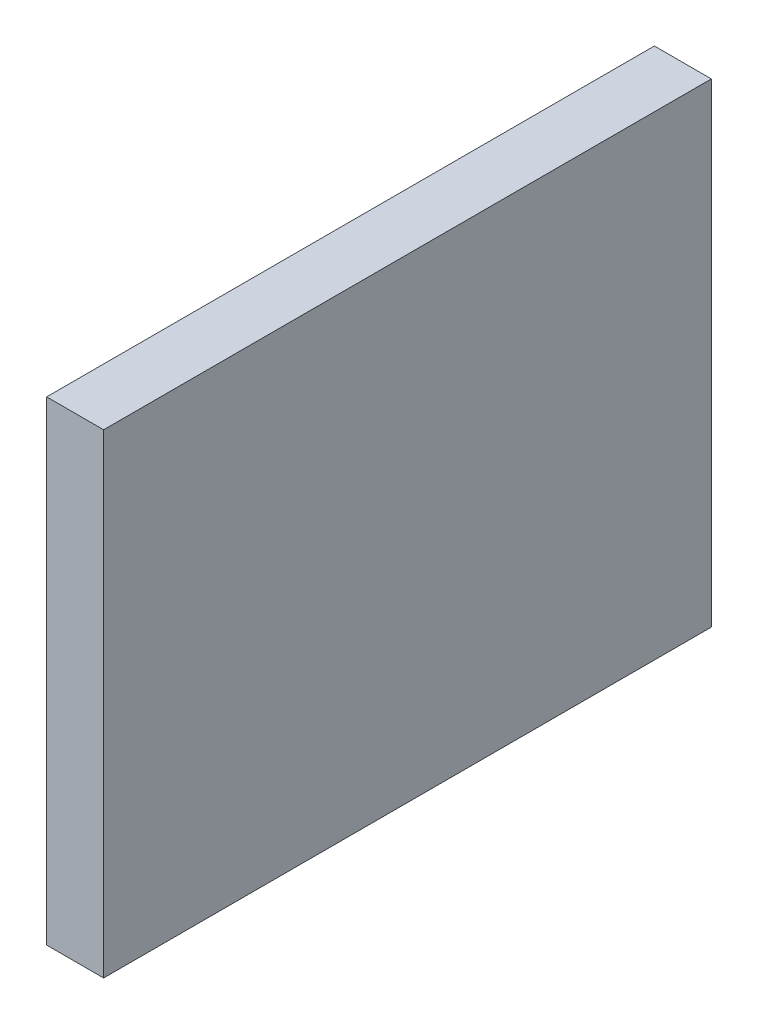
ISO-10303-21;
HEADER;
FILE_DESCRIPTION(('STEP AP214'),'2;1');
FILE_NAME('part.step','',(''),(''),'','','');
FILE_SCHEMA(('AUTOMOTIVE_DESIGN { 1 0 10303 214 1 1 1 1 }'));
ENDSEC;
DATA;
#1=APPLICATION_CONTEXT('core data for automotive mechanical design processes');
#2=APPLICATION_PROTOCOL_DEFINITION('international standard','automotive_design',2000,#1);
#3=PRODUCT_CONTEXT('',#1,'mechanical');
#4=PRODUCT('Part','Part','',(#3));
#5=PRODUCT_RELATED_PRODUCT_CATEGORY('part','',(#4));
#6=PRODUCT_DEFINITION_FORMATION('','',#4);
#7=PRODUCT_DEFINITION_CONTEXT('part definition',#1,'design');
#8=PRODUCT_DEFINITION('design','',#6,#7);
#9=PRODUCT_DEFINITION_SHAPE('','',#8);
#10=(LENGTH_UNIT() NAMED_UNIT(*) SI_UNIT(.MILLI.,.METRE.));
#11=(NAMED_UNIT(*) PLANE_ANGLE_UNIT() SI_UNIT($,.RADIAN.));
#12=(NAMED_UNIT(*) SI_UNIT($,.STERADIAN.) SOLID_ANGLE_UNIT());
#13=UNCERTAINTY_MEASURE_WITH_UNIT(LENGTH_MEASURE(1.E-05),#10,'distance_accuracy_value','');
#14=(GEOMETRIC_REPRESENTATION_CONTEXT(3) GLOBAL_UNCERTAINTY_ASSIGNED_CONTEXT((#13)) GLOBAL_UNIT_ASSIGNED_CONTEXT((#10,
#11,#12)) REPRESENTATION_CONTEXT('',''));
#15=CARTESIAN_POINT('',(0.,0.,0.));
#16=DIRECTION('',(0.,0.,1.));
#17=DIRECTION('',(1.,0.,0.));
#18=AXIS2_PLACEMENT_3D('',#15,#16,#17);
#19=CARTESIAN_POINT('',(3.048,0.,0.));
#20=DIRECTION('',(0.,0.,-1.));
#21=DIRECTION('',(-1.,0.,0.));
#22=AXIS2_PLACEMENT_3D('',#19,#20,#21);
#23=PLANE('',#22);
#24=DIRECTION('',(0.,-1.,0.));
#25=VECTOR('',#24,1.);
#26=CARTESIAN_POINT('',(0.,0.,0.));
#27=LINE('',#26,#25);
#28=CARTESIAN_POINT('',(0.,25.4,0.));
#29=VERTEX_POINT('',#28);
#30=CARTESIAN_POINT('',(0.,0.,0.));
#31=VERTEX_POINT('',#30);
#32=EDGE_CURVE('E96',#29,#31,#27,.T.);
#33=ORIENTED_EDGE('',*,*,#32,.T.);
#34=DIRECTION('',(-1.,0.,0.));
#35=VECTOR('',#34,1.);
#36=CARTESIAN_POINT('',(3.048,0.,0.));
#37=LINE('',#36,#35);
#38=CARTESIAN_POINT('',(3.048,0.,0.));
#39=VERTEX_POINT('',#38);
#40=EDGE_CURVE('E11',#39,#31,#37,.T.);
#41=ORIENTED_EDGE('',*,*,#40,.F.);
#42=DIRECTION('',(0.,-1.,0.));
#43=VECTOR('',#42,1.);
#44=CARTESIAN_POINT('',(3.048,0.,0.));
#45=LINE('',#44,#43);
#46=CARTESIAN_POINT('',(3.048,25.4,0.));
#47=VERTEX_POINT('',#46);
#48=EDGE_CURVE('E84',#47,#39,#45,.T.);
#49=ORIENTED_EDGE('',*,*,#48,.F.);
#50=DIRECTION('',(-1.,0.,0.));
#51=VECTOR('',#50,1.);
#52=CARTESIAN_POINT('',(3.048,25.4,0.));
#53=LINE('',#52,#51);
#54=EDGE_CURVE('E92',#47,#29,#53,.T.);
#55=ORIENTED_EDGE('',*,*,#54,.T.);
#56=EDGE_LOOP('',(#33,#41,#49,#55));
#57=FACE_BOUND('',#56,.T.);
#58=ADVANCED_FACE('F33',(#57),#23,.F.);
#59=CARTESIAN_POINT('',(3.048,0.,0.));
#60=DIRECTION('',(0.,1.,0.));
#61=DIRECTION('',(0.,0.,1.));
#62=AXIS2_PLACEMENT_3D('',#59,#60,#61);
#63=PLANE('',#62);
#64=DIRECTION('',(0.,0.,-1.));
#65=VECTOR('',#64,1.);
#66=CARTESIAN_POINT('',(0.,0.,0.));
#67=LINE('',#66,#65);
#68=CARTESIAN_POINT('',(0.,0.,-32.512));
#69=VERTEX_POINT('',#68);
#70=EDGE_CURVE('E88',#31,#69,#67,.T.);
#71=ORIENTED_EDGE('',*,*,#70,.T.);
#72=DIRECTION('',(-1.,0.,0.));
#73=VECTOR('',#72,1.);
#74=CARTESIAN_POINT('',(3.048,0.,-32.512));
#75=LINE('',#74,#73);
#76=CARTESIAN_POINT('',(3.048,0.,-32.512));
#77=VERTEX_POINT('',#76);
#78=EDGE_CURVE('E41',#77,#69,#75,.T.);
#79=ORIENTED_EDGE('',*,*,#78,.F.);
#80=DIRECTION('',(0.,0.,-1.));
#81=VECTOR('',#80,1.);
#82=CARTESIAN_POINT('',(3.048,0.,0.));
#83=LINE('',#82,#81);
#84=EDGE_CURVE('E79',#39,#77,#83,.T.);
#85=ORIENTED_EDGE('',*,*,#84,.F.);
#86=ORIENTED_EDGE('',*,*,#40,.T.);
#87=EDGE_LOOP('',(#71,#79,#85,#86));
#88=FACE_BOUND('',#87,.T.);
#89=ADVANCED_FACE('F87',(#88),#63,.F.);
#90=CARTESIAN_POINT('',(3.048,0.,-32.512));
#91=DIRECTION('',(0.,0.,1.));
#92=DIRECTION('',(1.,0.,0.));
#93=AXIS2_PLACEMENT_3D('',#90,#91,#92);
#94=PLANE('',#93);
#95=DIRECTION('',(0.,1.,0.));
#96=VECTOR('',#95,1.);
#97=CARTESIAN_POINT('',(0.,0.,-32.512));
#98=LINE('',#97,#96);
#99=CARTESIAN_POINT('',(0.,25.4,-32.512));
#100=VERTEX_POINT('',#99);
#101=EDGE_CURVE('E66',#69,#100,#98,.T.);
#102=ORIENTED_EDGE('',*,*,#101,.T.);
#103=DIRECTION('',(-1.,0.,0.));
#104=VECTOR('',#103,1.);
#105=CARTESIAN_POINT('',(3.048,25.4,-32.512));
#106=LINE('',#105,#104);
#107=CARTESIAN_POINT('',(3.048,25.4,-32.512));
#108=VERTEX_POINT('',#107);
#109=EDGE_CURVE('E89',#108,#100,#106,.T.);
#110=ORIENTED_EDGE('',*,*,#109,.F.);
#111=DIRECTION('',(0.,1.,0.));
#112=VECTOR('',#111,1.);
#113=CARTESIAN_POINT('',(3.048,0.,-32.512));
#114=LINE('',#113,#112);
#115=EDGE_CURVE('E82',#77,#108,#114,.T.);
#116=ORIENTED_EDGE('',*,*,#115,.F.);
#117=ORIENTED_EDGE('',*,*,#78,.T.);
#118=EDGE_LOOP('',(#102,#110,#116,#117));
#119=FACE_BOUND('',#118,.T.);
#120=ADVANCED_FACE('F90',(#119),#94,.F.);
#121=CARTESIAN_POINT('',(3.048,25.4,0.));
#122=DIRECTION('',(0.,-1.,0.));
#123=DIRECTION('',(0.,0.,-1.));
#124=AXIS2_PLACEMENT_3D('',#121,#122,#123);
#125=PLANE('',#124);
#126=DIRECTION('',(0.,0.,1.));
#127=VECTOR('',#126,1.);
#128=CARTESIAN_POINT('',(0.,25.4,0.));
#129=LINE('',#128,#127);
#130=EDGE_CURVE('E72',#100,#29,#129,.T.);
#131=ORIENTED_EDGE('',*,*,#130,.T.);
#132=ORIENTED_EDGE('',*,*,#54,.F.);
#133=DIRECTION('',(0.,0.,1.));
#134=VECTOR('',#133,1.);
#135=CARTESIAN_POINT('',(3.048,25.4,0.));
#136=LINE('',#135,#134);
#137=EDGE_CURVE('E49',#108,#47,#136,.T.);
#138=ORIENTED_EDGE('',*,*,#137,.F.);
#139=ORIENTED_EDGE('',*,*,#109,.T.);
#140=EDGE_LOOP('',(#131,#132,#138,#139));
#141=FACE_BOUND('',#140,.T.);
#142=ADVANCED_FACE('F103',(#141),#125,.F.);
#143=CARTESIAN_POINT('',(3.048,0.,0.));
#144=DIRECTION('',(-1.,0.,0.));
#145=DIRECTION('',(0.,0.,1.));
#146=AXIS2_PLACEMENT_3D('',#143,#144,#145);
#147=PLANE('',#146);
#148=ORIENTED_EDGE('',*,*,#48,.T.);
#149=ORIENTED_EDGE('',*,*,#84,.T.);
#150=ORIENTED_EDGE('',*,*,#115,.T.);
#151=ORIENTED_EDGE('',*,*,#137,.T.);
#152=EDGE_LOOP('',(#148,#149,#150,#151));
#153=FACE_BOUND('',#152,.T.);
#154=ADVANCED_FACE('F80',(#153),#147,.F.);
#155=CARTESIAN_POINT('',(0.,0.,0.));
#156=DIRECTION('',(-1.,0.,0.));
#157=DIRECTION('',(0.,0.,1.));
#158=AXIS2_PLACEMENT_3D('',#155,#156,#157);
#159=PLANE('',#158);
#160=ORIENTED_EDGE('',*,*,#32,.F.);
#161=ORIENTED_EDGE('',*,*,#130,.F.);
#162=ORIENTED_EDGE('',*,*,#101,.F.);
#163=ORIENTED_EDGE('',*,*,#70,.F.);
#164=EDGE_LOOP('',(#160,#161,#162,#163));
#165=FACE_BOUND('',#164,.T.);
#166=ADVANCED_FACE('F106',(#165),#159,.T.);
#167=CLOSED_SHELL('',(#58,#89,#120,#142,#154,#166));
#168=MANIFOLD_SOLID_BREP('B2',#167);
#169=ADVANCED_BREP_SHAPE_REPRESENTATION('',(#18,#168),#14);
#170=SHAPE_DEFINITION_REPRESENTATION(#9,#169);
ENDSEC;
END-ISO-10303-21;
